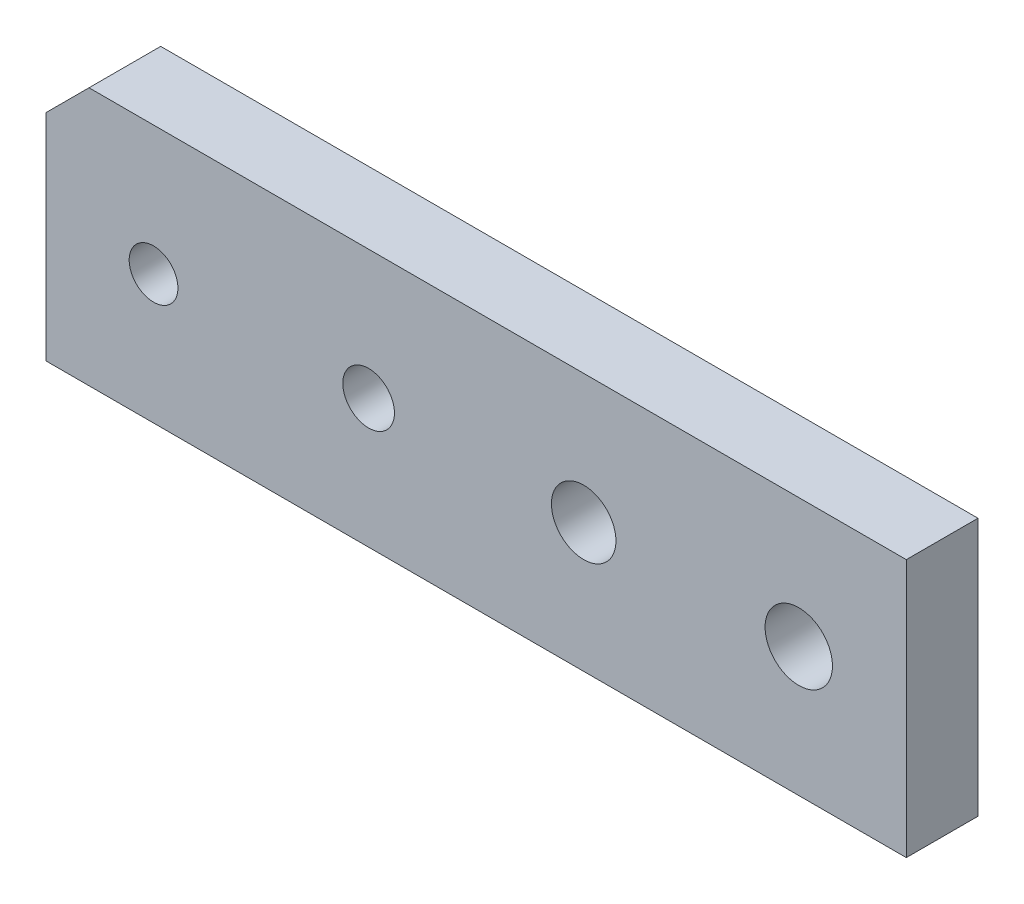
ISO-10303-21;
HEADER;
FILE_DESCRIPTION(('STEP AP214'),'2;1');
FILE_NAME('part.step','',(''),(''),'','','');
FILE_SCHEMA(('AUTOMOTIVE_DESIGN { 1 0 10303 214 1 1 1 1 }'));
ENDSEC;
DATA;
#1=APPLICATION_CONTEXT('core data for automotive mechanical design processes');
#2=APPLICATION_PROTOCOL_DEFINITION('international standard','automotive_design',2000,#1);
#3=PRODUCT_CONTEXT('',#1,'mechanical');
#4=PRODUCT('Part','Part','',(#3));
#5=PRODUCT_RELATED_PRODUCT_CATEGORY('part','',(#4));
#6=PRODUCT_DEFINITION_FORMATION('','',#4);
#7=PRODUCT_DEFINITION_CONTEXT('part definition',#1,'design');
#8=PRODUCT_DEFINITION('design','',#6,#7);
#9=PRODUCT_DEFINITION_SHAPE('','',#8);
#10=(LENGTH_UNIT() NAMED_UNIT(*) SI_UNIT(.MILLI.,.METRE.));
#11=(NAMED_UNIT(*) PLANE_ANGLE_UNIT() SI_UNIT($,.RADIAN.));
#12=(NAMED_UNIT(*) SI_UNIT($,.STERADIAN.) SOLID_ANGLE_UNIT());
#13=UNCERTAINTY_MEASURE_WITH_UNIT(LENGTH_MEASURE(1.E-05),#10,'distance_accuracy_value','');
#14=(GEOMETRIC_REPRESENTATION_CONTEXT(3) GLOBAL_UNCERTAINTY_ASSIGNED_CONTEXT((#13)) GLOBAL_UNIT_ASSIGNED_CONTEXT((#10,
#11,#12)) REPRESENTATION_CONTEXT('',''));
#15=CARTESIAN_POINT('',(0.,0.,0.));
#16=DIRECTION('',(0.,0.,1.));
#17=DIRECTION('',(1.,0.,0.));
#18=AXIS2_PLACEMENT_3D('',#15,#16,#17);
#19=CARTESIAN_POINT('',(0.,0.,5.));
#20=DIRECTION('',(0.,0.,1.));
#21=DIRECTION('',(1.,0.,0.));
#22=AXIS2_PLACEMENT_3D('',#19,#20,#21);
#23=PLANE('',#22);
#24=CARTESIAN_POINT('',(7.5,0.,5.));
#25=DIRECTION('',(0.,0.,1.));
#26=DIRECTION('',(1.,0.,0.));
#27=AXIS2_PLACEMENT_3D('',#24,#25,#26);
#28=CIRCLE('',#27,2.25);
#29=CARTESIAN_POINT('',(9.75,0.,5.));
#30=VERTEX_POINT('',#29);
#31=EDGE_CURVE('E182',#30,#30,#28,.T.);
#32=ORIENTED_EDGE('',*,*,#31,.F.);
#33=EDGE_LOOP('',(#32));
#34=FACE_BOUND('',#33,.T.);
#35=CARTESIAN_POINT('',(-22.5,0.,5.));
#36=DIRECTION('',(0.,0.,1.));
#37=DIRECTION('',(1.,0.,0.));
#38=AXIS2_PLACEMENT_3D('',#35,#36,#37);
#39=CIRCLE('',#38,1.7);
#40=CARTESIAN_POINT('',(-20.8,0.,5.));
#41=VERTEX_POINT('',#40);
#42=EDGE_CURVE('E122',#41,#41,#39,.T.);
#43=ORIENTED_EDGE('',*,*,#42,.F.);
#44=EDGE_LOOP('',(#43));
#45=FACE_BOUND('',#44,.T.);
#46=DIRECTION('',(0.,-1.,0.));
#47=VECTOR('',#46,1.);
#48=CARTESIAN_POINT('',(-30.,6.,5.));
#49=LINE('',#48,#47);
#50=CARTESIAN_POINT('',(-30.,6.,5.));
#51=VERTEX_POINT('',#50);
#52=CARTESIAN_POINT('',(-30.,-9.,5.));
#53=VERTEX_POINT('',#52);
#54=EDGE_CURVE('E127',#51,#53,#49,.T.);
#55=ORIENTED_EDGE('',*,*,#54,.T.);
#56=DIRECTION('',(1.,0.,0.));
#57=VECTOR('',#56,1.);
#58=CARTESIAN_POINT('',(-30.,-9.,5.));
#59=LINE('',#58,#57);
#60=CARTESIAN_POINT('',(30.,-9.,5.));
#61=VERTEX_POINT('',#60);
#62=EDGE_CURVE('E94',#53,#61,#59,.T.);
#63=ORIENTED_EDGE('',*,*,#62,.T.);
#64=DIRECTION('',(0.,1.,0.));
#65=VECTOR('',#64,1.);
#66=CARTESIAN_POINT('',(30.,-9.,5.));
#67=LINE('',#66,#65);
#68=CARTESIAN_POINT('',(30.,9.,5.));
#69=VERTEX_POINT('',#68);
#70=EDGE_CURVE('E98',#61,#69,#67,.T.);
#71=ORIENTED_EDGE('',*,*,#70,.T.);
#72=DIRECTION('',(-1.,0.,0.));
#73=VECTOR('',#72,1.);
#74=CARTESIAN_POINT('',(30.,9.,5.));
#75=LINE('',#74,#73);
#76=CARTESIAN_POINT('',(-27.,9.,5.));
#77=VERTEX_POINT('',#76);
#78=EDGE_CURVE('E102',#69,#77,#75,.T.);
#79=ORIENTED_EDGE('',*,*,#78,.T.);
#80=DIRECTION('',(-0.707106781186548,-0.707106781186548,0.));
#81=VECTOR('',#80,1.);
#82=CARTESIAN_POINT('',(-27.,9.,5.));
#83=LINE('',#82,#81);
#84=EDGE_CURVE('E60',#77,#51,#83,.T.);
#85=ORIENTED_EDGE('',*,*,#84,.T.);
#86=EDGE_LOOP('',(#55,#63,#71,#79,#85));
#87=FACE_BOUND('',#86,.T.);
#88=CARTESIAN_POINT('',(-7.5,0.,5.));
#89=DIRECTION('',(0.,0.,1.));
#90=DIRECTION('',(1.,0.,0.));
#91=AXIS2_PLACEMENT_3D('',#88,#89,#90);
#92=CIRCLE('',#91,1.8);
#93=CARTESIAN_POINT('',(-5.7,0.,5.));
#94=VERTEX_POINT('',#93);
#95=EDGE_CURVE('E188',#94,#94,#92,.T.);
#96=ORIENTED_EDGE('',*,*,#95,.F.);
#97=EDGE_LOOP('',(#96));
#98=FACE_BOUND('',#97,.T.);
#99=CARTESIAN_POINT('',(22.5,0.,5.));
#100=DIRECTION('',(0.,0.,1.));
#101=DIRECTION('',(1.,0.,0.));
#102=AXIS2_PLACEMENT_3D('',#99,#100,#101);
#103=CIRCLE('',#102,2.35);
#104=CARTESIAN_POINT('',(24.85,0.,5.));
#105=VERTEX_POINT('',#104);
#106=EDGE_CURVE('E173',#105,#105,#103,.T.);
#107=ORIENTED_EDGE('',*,*,#106,.F.);
#108=EDGE_LOOP('',(#107));
#109=FACE_BOUND('',#108,.T.);
#110=ADVANCED_FACE('F43',(#34,#45,#87,#98,#109),#23,.T.);
#111=CARTESIAN_POINT('',(0.,0.,0.));
#112=DIRECTION('',(0.,0.,1.));
#113=DIRECTION('',(1.,0.,0.));
#114=AXIS2_PLACEMENT_3D('',#111,#112,#113);
#115=PLANE('',#114);
#116=DIRECTION('',(0.,-1.,0.));
#117=VECTOR('',#116,1.);
#118=CARTESIAN_POINT('',(-30.,6.,0.));
#119=LINE('',#118,#117);
#120=CARTESIAN_POINT('',(-30.,6.,0.));
#121=VERTEX_POINT('',#120);
#122=CARTESIAN_POINT('',(-30.,-9.,0.));
#123=VERTEX_POINT('',#122);
#124=EDGE_CURVE('E118',#121,#123,#119,.T.);
#125=ORIENTED_EDGE('',*,*,#124,.F.);
#126=DIRECTION('',(-0.707106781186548,-0.707106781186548,0.));
#127=VECTOR('',#126,1.);
#128=CARTESIAN_POINT('',(-27.,9.,0.));
#129=LINE('',#128,#127);
#130=CARTESIAN_POINT('',(-27.,9.,0.));
#131=VERTEX_POINT('',#130);
#132=EDGE_CURVE('E86',#131,#121,#129,.T.);
#133=ORIENTED_EDGE('',*,*,#132,.F.);
#134=DIRECTION('',(-1.,0.,0.));
#135=VECTOR('',#134,1.);
#136=CARTESIAN_POINT('',(30.,9.,0.));
#137=LINE('',#136,#135);
#138=CARTESIAN_POINT('',(30.,9.,0.));
#139=VERTEX_POINT('',#138);
#140=EDGE_CURVE('E80',#139,#131,#137,.T.);
#141=ORIENTED_EDGE('',*,*,#140,.F.);
#142=DIRECTION('',(0.,1.,0.));
#143=VECTOR('',#142,1.);
#144=CARTESIAN_POINT('',(30.,-9.,0.));
#145=LINE('',#144,#143);
#146=CARTESIAN_POINT('',(30.,-9.,0.));
#147=VERTEX_POINT('',#146);
#148=EDGE_CURVE('E109',#147,#139,#145,.T.);
#149=ORIENTED_EDGE('',*,*,#148,.F.);
#150=DIRECTION('',(1.,0.,0.));
#151=VECTOR('',#150,1.);
#152=CARTESIAN_POINT('',(-30.,-9.,0.));
#153=LINE('',#152,#151);
#154=EDGE_CURVE('E121',#123,#147,#153,.T.);
#155=ORIENTED_EDGE('',*,*,#154,.F.);
#156=EDGE_LOOP('',(#125,#133,#141,#149,#155));
#157=FACE_BOUND('',#156,.T.);
#158=CARTESIAN_POINT('',(-22.5,0.,0.));
#159=DIRECTION('',(0.,0.,1.));
#160=DIRECTION('',(1.,0.,0.));
#161=AXIS2_PLACEMENT_3D('',#158,#159,#160);
#162=CIRCLE('',#161,1.7);
#163=CARTESIAN_POINT('',(-20.8,0.,0.));
#164=VERTEX_POINT('',#163);
#165=EDGE_CURVE('E191',#164,#164,#162,.T.);
#166=ORIENTED_EDGE('',*,*,#165,.T.);
#167=EDGE_LOOP('',(#166));
#168=FACE_BOUND('',#167,.T.);
#169=CARTESIAN_POINT('',(-7.5,0.,0.));
#170=DIRECTION('',(0.,0.,1.));
#171=DIRECTION('',(1.,0.,0.));
#172=AXIS2_PLACEMENT_3D('',#169,#170,#171);
#173=CIRCLE('',#172,1.8);
#174=CARTESIAN_POINT('',(-5.7,0.,0.));
#175=VERTEX_POINT('',#174);
#176=EDGE_CURVE('E185',#175,#175,#173,.T.);
#177=ORIENTED_EDGE('',*,*,#176,.T.);
#178=EDGE_LOOP('',(#177));
#179=FACE_BOUND('',#178,.T.);
#180=CARTESIAN_POINT('',(7.5,0.,0.));
#181=DIRECTION('',(0.,0.,1.));
#182=DIRECTION('',(1.,0.,0.));
#183=AXIS2_PLACEMENT_3D('',#180,#181,#182);
#184=CIRCLE('',#183,2.25);
#185=CARTESIAN_POINT('',(9.75,0.,0.));
#186=VERTEX_POINT('',#185);
#187=EDGE_CURVE('E179',#186,#186,#184,.T.);
#188=ORIENTED_EDGE('',*,*,#187,.T.);
#189=EDGE_LOOP('',(#188));
#190=FACE_BOUND('',#189,.T.);
#191=CARTESIAN_POINT('',(22.5,0.,0.));
#192=DIRECTION('',(0.,0.,1.));
#193=DIRECTION('',(1.,0.,0.));
#194=AXIS2_PLACEMENT_3D('',#191,#192,#193);
#195=CIRCLE('',#194,2.35);
#196=CARTESIAN_POINT('',(24.85,0.,0.));
#197=VERTEX_POINT('',#196);
#198=EDGE_CURVE('E176',#197,#197,#195,.T.);
#199=ORIENTED_EDGE('',*,*,#198,.T.);
#200=EDGE_LOOP('',(#199));
#201=FACE_BOUND('',#200,.T.);
#202=ADVANCED_FACE('F131',(#157,#168,#179,#190,#201),#115,.F.);
#203=CARTESIAN_POINT('',(-30.,6.,5.));
#204=DIRECTION('',(1.,0.,0.));
#205=DIRECTION('',(0.,0.,-1.));
#206=AXIS2_PLACEMENT_3D('',#203,#204,#205);
#207=PLANE('',#206);
#208=ORIENTED_EDGE('',*,*,#124,.T.);
#209=DIRECTION('',(0.,0.,-1.));
#210=VECTOR('',#209,1.);
#211=CARTESIAN_POINT('',(-30.,-9.,5.));
#212=LINE('',#211,#210);
#213=EDGE_CURVE('E11',#53,#123,#212,.T.);
#214=ORIENTED_EDGE('',*,*,#213,.F.);
#215=ORIENTED_EDGE('',*,*,#54,.F.);
#216=DIRECTION('',(0.,0.,-1.));
#217=VECTOR('',#216,1.);
#218=CARTESIAN_POINT('',(-30.,6.,5.));
#219=LINE('',#218,#217);
#220=EDGE_CURVE('E114',#51,#121,#219,.T.);
#221=ORIENTED_EDGE('',*,*,#220,.T.);
#222=EDGE_LOOP('',(#208,#214,#215,#221));
#223=FACE_BOUND('',#222,.T.);
#224=ADVANCED_FACE('F45',(#223),#207,.F.);
#225=CARTESIAN_POINT('',(-30.,-9.,5.));
#226=DIRECTION('',(0.,1.,0.));
#227=DIRECTION('',(0.,0.,1.));
#228=AXIS2_PLACEMENT_3D('',#225,#226,#227);
#229=PLANE('',#228);
#230=ORIENTED_EDGE('',*,*,#154,.T.);
#231=DIRECTION('',(0.,0.,-1.));
#232=VECTOR('',#231,1.);
#233=CARTESIAN_POINT('',(30.,-9.,5.));
#234=LINE('',#233,#232);
#235=EDGE_CURVE('E52',#61,#147,#234,.T.);
#236=ORIENTED_EDGE('',*,*,#235,.F.);
#237=ORIENTED_EDGE('',*,*,#62,.F.);
#238=ORIENTED_EDGE('',*,*,#213,.T.);
#239=EDGE_LOOP('',(#230,#236,#237,#238));
#240=FACE_BOUND('',#239,.T.);
#241=ADVANCED_FACE('F244',(#240),#229,.F.);
#242=CARTESIAN_POINT('',(30.,-9.,5.));
#243=DIRECTION('',(-1.,0.,0.));
#244=DIRECTION('',(0.,0.,1.));
#245=AXIS2_PLACEMENT_3D('',#242,#243,#244);
#246=PLANE('',#245);
#247=ORIENTED_EDGE('',*,*,#148,.T.);
#248=DIRECTION('',(0.,0.,-1.));
#249=VECTOR('',#248,1.);
#250=CARTESIAN_POINT('',(30.,9.,5.));
#251=LINE('',#250,#249);
#252=EDGE_CURVE('E106',#69,#139,#251,.T.);
#253=ORIENTED_EDGE('',*,*,#252,.F.);
#254=ORIENTED_EDGE('',*,*,#70,.F.);
#255=ORIENTED_EDGE('',*,*,#235,.T.);
#256=EDGE_LOOP('',(#247,#253,#254,#255));
#257=FACE_BOUND('',#256,.T.);
#258=ADVANCED_FACE('F107',(#257),#246,.F.);
#259=CARTESIAN_POINT('',(30.,9.,5.));
#260=DIRECTION('',(0.,-1.,0.));
#261=DIRECTION('',(0.,0.,-1.));
#262=AXIS2_PLACEMENT_3D('',#259,#260,#261);
#263=PLANE('',#262);
#264=ORIENTED_EDGE('',*,*,#140,.T.);
#265=DIRECTION('',(0.,0.,-1.));
#266=VECTOR('',#265,1.);
#267=CARTESIAN_POINT('',(-27.,9.,5.));
#268=LINE('',#267,#266);
#269=EDGE_CURVE('E110',#77,#131,#268,.T.);
#270=ORIENTED_EDGE('',*,*,#269,.F.);
#271=ORIENTED_EDGE('',*,*,#78,.F.);
#272=ORIENTED_EDGE('',*,*,#252,.T.);
#273=EDGE_LOOP('',(#264,#270,#271,#272));
#274=FACE_BOUND('',#273,.T.);
#275=ADVANCED_FACE('F112',(#274),#263,.F.);
#276=CARTESIAN_POINT('',(-27.,9.,5.));
#277=DIRECTION('',(0.707106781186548,-0.707106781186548,0.));
#278=DIRECTION('',(0.707106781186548,0.707106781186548,0.));
#279=AXIS2_PLACEMENT_3D('',#276,#277,#278);
#280=PLANE('',#279);
#281=ORIENTED_EDGE('',*,*,#132,.T.);
#282=ORIENTED_EDGE('',*,*,#220,.F.);
#283=ORIENTED_EDGE('',*,*,#84,.F.);
#284=ORIENTED_EDGE('',*,*,#269,.T.);
#285=EDGE_LOOP('',(#281,#282,#283,#284));
#286=FACE_BOUND('',#285,.T.);
#287=ADVANCED_FACE('F136',(#286),#280,.F.);
#288=CARTESIAN_POINT('',(-22.5,0.,5.));
#289=DIRECTION('',(0.,0.,-1.));
#290=DIRECTION('',(-1.,0.,0.));
#291=AXIS2_PLACEMENT_3D('',#288,#289,#290);
#292=CYLINDRICAL_SURFACE('',#291,1.7);
#293=ORIENTED_EDGE('',*,*,#42,.T.);
#294=EDGE_LOOP('',(#293));
#295=FACE_BOUND('',#294,.T.);
#296=ORIENTED_EDGE('',*,*,#165,.F.);
#297=EDGE_LOOP('',(#296));
#298=FACE_BOUND('',#297,.T.);
#299=ADVANCED_FACE('F138',(#295,#298),#292,.F.);
#300=CARTESIAN_POINT('',(-7.5,0.,5.));
#301=DIRECTION('',(0.,0.,-1.));
#302=DIRECTION('',(-1.,0.,0.));
#303=AXIS2_PLACEMENT_3D('',#300,#301,#302);
#304=CYLINDRICAL_SURFACE('',#303,1.8);
#305=ORIENTED_EDGE('',*,*,#95,.T.);
#306=EDGE_LOOP('',(#305));
#307=FACE_BOUND('',#306,.T.);
#308=ORIENTED_EDGE('',*,*,#176,.F.);
#309=EDGE_LOOP('',(#308));
#310=FACE_BOUND('',#309,.T.);
#311=ADVANCED_FACE('F144',(#307,#310),#304,.F.);
#312=CARTESIAN_POINT('',(7.5,0.,5.));
#313=DIRECTION('',(0.,0.,-1.));
#314=DIRECTION('',(-1.,0.,0.));
#315=AXIS2_PLACEMENT_3D('',#312,#313,#314);
#316=CYLINDRICAL_SURFACE('',#315,2.25);
#317=ORIENTED_EDGE('',*,*,#31,.T.);
#318=EDGE_LOOP('',(#317));
#319=FACE_BOUND('',#318,.T.);
#320=ORIENTED_EDGE('',*,*,#187,.F.);
#321=EDGE_LOOP('',(#320));
#322=FACE_BOUND('',#321,.T.);
#323=ADVANCED_FACE('F160',(#319,#322),#316,.F.);
#324=CARTESIAN_POINT('',(22.5,0.,5.));
#325=DIRECTION('',(0.,0.,-1.));
#326=DIRECTION('',(-1.,0.,0.));
#327=AXIS2_PLACEMENT_3D('',#324,#325,#326);
#328=CYLINDRICAL_SURFACE('',#327,2.35);
#329=ORIENTED_EDGE('',*,*,#106,.T.);
#330=EDGE_LOOP('',(#329));
#331=FACE_BOUND('',#330,.T.);
#332=ORIENTED_EDGE('',*,*,#198,.F.);
#333=EDGE_LOOP('',(#332));
#334=FACE_BOUND('',#333,.T.);
#335=ADVANCED_FACE('F164',(#331,#334),#328,.F.);
#336=CLOSED_SHELL('',(#110,#202,#224,#241,#258,#275,#287,#299,#311,#323,#335));
#337=MANIFOLD_SOLID_BREP('B2',#336);
#338=ADVANCED_BREP_SHAPE_REPRESENTATION('',(#18,#337),#14);
#339=SHAPE_DEFINITION_REPRESENTATION(#9,#338);
ENDSEC;
END-ISO-10303-21;
